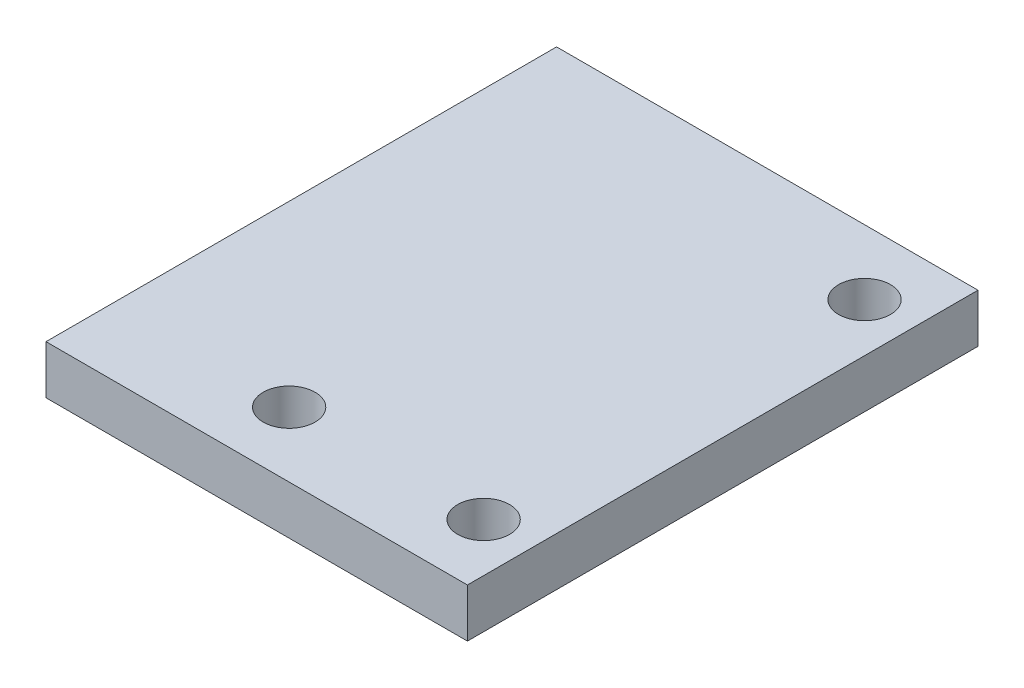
from build123d import *

# Parameters (mm, degrees)
SKETCH1_W           = 26
SKETCH1_H           = 31.5
SKETCH1_R           = 1.6
BOSS_EXTRUDE1_DEPTH = 3


with BuildPart() as part:
    # Sketch1 → Boss-Extrude1 (new body)
    with BuildSketch(Plane(origin=(0, 0, 0), x_dir=(1, 0, 0), z_dir=(0, 1, 0))):
        with Locations((-10, 0.347475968)):
            Rectangle(SKETCH1_W, SKETCH1_H)
        with Locations(Location((0, 12.097475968, 0), (0, 0, 270))):
            Circle(SKETCH1_R, mode=Mode.SUBTRACT)
        with Locations(Location((0, -11.402524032, 0), (0, 0, 270))):
            Circle(SKETCH1_R, mode=Mode.SUBTRACT)
        with Locations(Location((-12, -11.402524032, 0), (0, 0, 270))):
            Circle(SKETCH1_R, mode=Mode.SUBTRACT)
    extrude(amount=BOSS_EXTRUDE1_DEPTH)


solid = part.part
